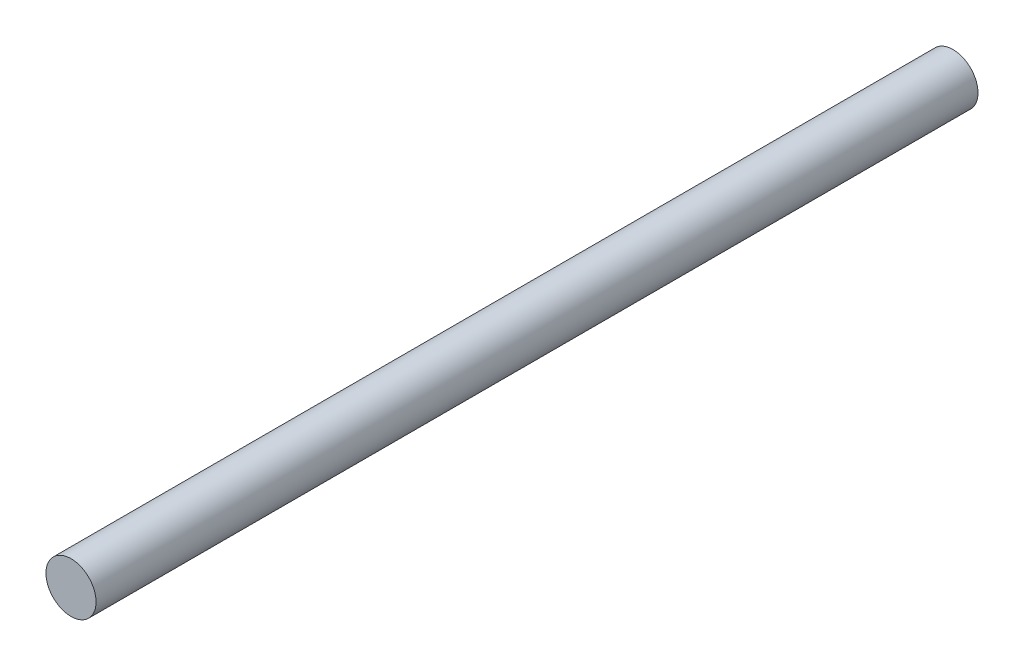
ISO-10303-21;
HEADER;
FILE_DESCRIPTION(('STEP AP214'),'2;1');
FILE_NAME('part.step','',(''),(''),'','','');
FILE_SCHEMA(('AUTOMOTIVE_DESIGN { 1 0 10303 214 1 1 1 1 }'));
ENDSEC;
DATA;
#1=APPLICATION_CONTEXT('core data for automotive mechanical design processes');
#2=APPLICATION_PROTOCOL_DEFINITION('international standard','automotive_design',2000,#1);
#3=PRODUCT_CONTEXT('',#1,'mechanical');
#4=PRODUCT('Part','Part','',(#3));
#5=PRODUCT_RELATED_PRODUCT_CATEGORY('part','',(#4));
#6=PRODUCT_DEFINITION_FORMATION('','',#4);
#7=PRODUCT_DEFINITION_CONTEXT('part definition',#1,'design');
#8=PRODUCT_DEFINITION('design','',#6,#7);
#9=PRODUCT_DEFINITION_SHAPE('','',#8);
#10=(LENGTH_UNIT() NAMED_UNIT(*) SI_UNIT(.MILLI.,.METRE.));
#11=(NAMED_UNIT(*) PLANE_ANGLE_UNIT() SI_UNIT($,.RADIAN.));
#12=(NAMED_UNIT(*) SI_UNIT($,.STERADIAN.) SOLID_ANGLE_UNIT());
#13=UNCERTAINTY_MEASURE_WITH_UNIT(LENGTH_MEASURE(1.E-05),#10,'distance_accuracy_value','');
#14=(GEOMETRIC_REPRESENTATION_CONTEXT(3) GLOBAL_UNCERTAINTY_ASSIGNED_CONTEXT((#13)) GLOBAL_UNIT_ASSIGNED_CONTEXT((#10,
#11,#12)) REPRESENTATION_CONTEXT('',''));
#15=CARTESIAN_POINT('',(0.,0.,0.));
#16=DIRECTION('',(0.,0.,1.));
#17=DIRECTION('',(1.,0.,0.));
#18=AXIS2_PLACEMENT_3D('',#15,#16,#17);
#19=CARTESIAN_POINT('',(0.,0.,27.94));
#20=DIRECTION('',(0.,0.,-1.));
#21=DIRECTION('',(-1.,0.,0.));
#22=AXIS2_PLACEMENT_3D('',#19,#20,#21);
#23=CYLINDRICAL_SURFACE('',#22,1.5875);
#24=CARTESIAN_POINT('',(0.,0.,27.94));
#25=DIRECTION('',(0.,0.,1.));
#26=DIRECTION('',(1.,0.,0.));
#27=AXIS2_PLACEMENT_3D('',#24,#25,#26);
#28=CIRCLE('',#27,1.5875);
#29=CARTESIAN_POINT('',(1.5875,0.,27.94));
#30=VERTEX_POINT('',#29);
#31=EDGE_CURVE('E10',#30,#30,#28,.T.);
#32=ORIENTED_EDGE('',*,*,#31,.F.);
#33=EDGE_LOOP('',(#32));
#34=FACE_BOUND('',#33,.T.);
#35=CARTESIAN_POINT('',(0.,0.,-27.94));
#36=DIRECTION('',(0.,0.,1.));
#37=DIRECTION('',(1.,0.,0.));
#38=AXIS2_PLACEMENT_3D('',#35,#36,#37);
#39=CIRCLE('',#38,1.5875);
#40=CARTESIAN_POINT('',(1.5875,0.,-27.94));
#41=VERTEX_POINT('',#40);
#42=EDGE_CURVE('E45',#41,#41,#39,.T.);
#43=ORIENTED_EDGE('',*,*,#42,.T.);
#44=EDGE_LOOP('',(#43));
#45=FACE_BOUND('',#44,.T.);
#46=ADVANCED_FACE('F39',(#34,#45),#23,.T.);
#47=CARTESIAN_POINT('',(0.,0.,27.94));
#48=DIRECTION('',(0.,0.,1.));
#49=DIRECTION('',(1.,0.,0.));
#50=AXIS2_PLACEMENT_3D('',#47,#48,#49);
#51=PLANE('',#50);
#52=ORIENTED_EDGE('',*,*,#31,.T.);
#53=EDGE_LOOP('',(#52));
#54=FACE_BOUND('',#53,.T.);
#55=ADVANCED_FACE('F53',(#54),#51,.T.);
#56=CARTESIAN_POINT('',(0.,0.,-27.94));
#57=DIRECTION('',(0.,0.,1.));
#58=DIRECTION('',(1.,0.,0.));
#59=AXIS2_PLACEMENT_3D('',#56,#57,#58);
#60=PLANE('',#59);
#61=ORIENTED_EDGE('',*,*,#42,.F.);
#62=EDGE_LOOP('',(#61));
#63=FACE_BOUND('',#62,.T.);
#64=ADVANCED_FACE('F55',(#63),#60,.F.);
#65=CLOSED_SHELL('',(#46,#55,#64));
#66=MANIFOLD_SOLID_BREP('B2',#65);
#67=ADVANCED_BREP_SHAPE_REPRESENTATION('',(#18,#66),#14);
#68=SHAPE_DEFINITION_REPRESENTATION(#9,#67);
ENDSEC;
END-ISO-10303-21;
